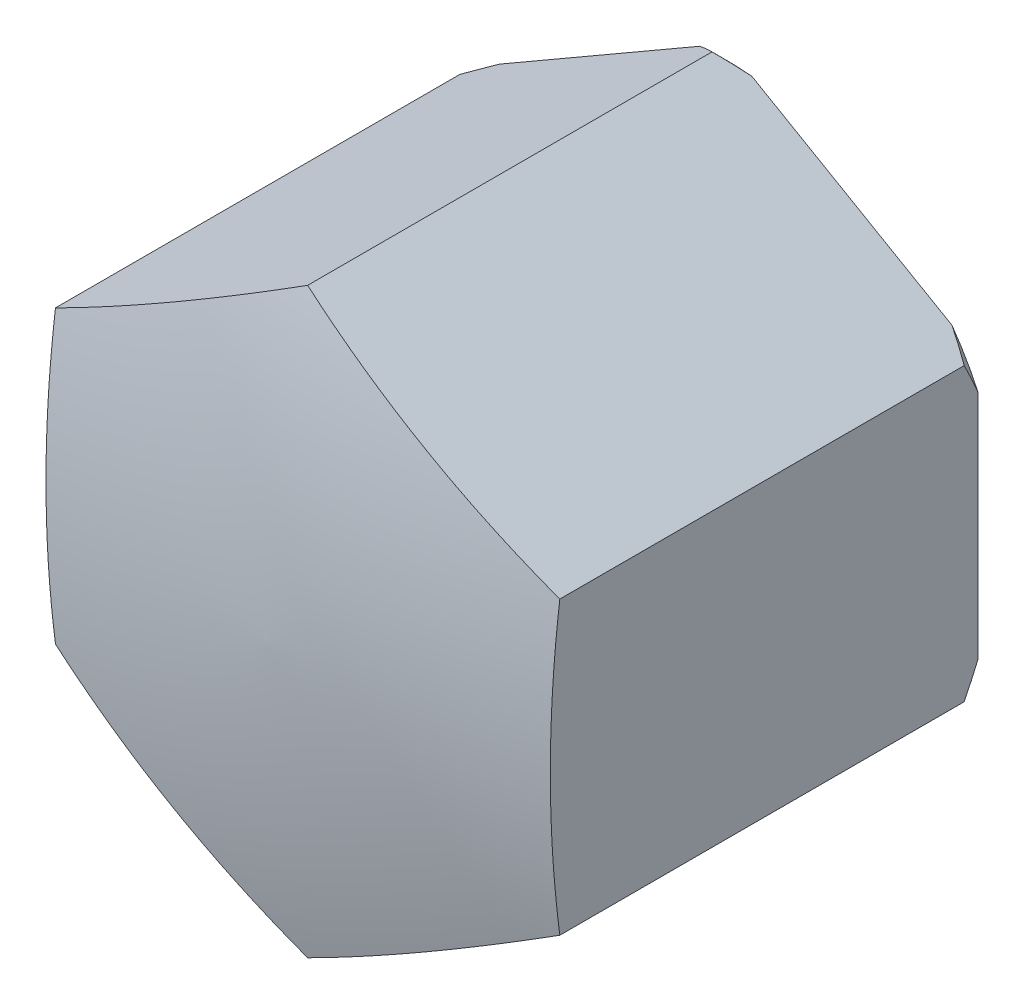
ISO-10303-21;
HEADER;
FILE_DESCRIPTION(('STEP AP214'),'2;1');
FILE_NAME('part.step','',(''),(''),'','','');
FILE_SCHEMA(('AUTOMOTIVE_DESIGN { 1 0 10303 214 1 1 1 1 }'));
ENDSEC;
DATA;
#1=APPLICATION_CONTEXT('core data for automotive mechanical design processes');
#2=APPLICATION_PROTOCOL_DEFINITION('international standard','automotive_design',2000,#1);
#3=PRODUCT_CONTEXT('',#1,'mechanical');
#4=PRODUCT('Part','Part','',(#3));
#5=PRODUCT_RELATED_PRODUCT_CATEGORY('part','',(#4));
#6=PRODUCT_DEFINITION_FORMATION('','',#4);
#7=PRODUCT_DEFINITION_CONTEXT('part definition',#1,'design');
#8=PRODUCT_DEFINITION('design','',#6,#7);
#9=PRODUCT_DEFINITION_SHAPE('','',#8);
#10=(LENGTH_UNIT() NAMED_UNIT(*) SI_UNIT(.MILLI.,.METRE.));
#11=(NAMED_UNIT(*) PLANE_ANGLE_UNIT() SI_UNIT($,.RADIAN.));
#12=(NAMED_UNIT(*) SI_UNIT($,.STERADIAN.) SOLID_ANGLE_UNIT());
#13=UNCERTAINTY_MEASURE_WITH_UNIT(LENGTH_MEASURE(1.E-05),#10,'distance_accuracy_value','');
#14=(GEOMETRIC_REPRESENTATION_CONTEXT(3) GLOBAL_UNCERTAINTY_ASSIGNED_CONTEXT((#13)) GLOBAL_UNIT_ASSIGNED_CONTEXT((#10,
#11,#12)) REPRESENTATION_CONTEXT('',''));
#15=CARTESIAN_POINT('',(0.,0.,0.));
#16=DIRECTION('',(0.,0.,1.));
#17=DIRECTION('',(1.,0.,0.));
#18=AXIS2_PLACEMENT_3D('',#15,#16,#17);
#19=CARTESIAN_POINT('',(0.,0.,0.));
#20=DIRECTION('',(0.,0.,1.));
#21=DIRECTION('',(0.,-1.,0.));
#22=AXIS2_PLACEMENT_3D('',#19,#20,#21);
#23=CONICAL_SURFACE('',#22,12.1,0.785398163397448);
#24=CARTESIAN_POINT('',(-9.86507388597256,7.00610285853,-0.000199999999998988));
#25=CARTESIAN_POINT('',(-9.96119990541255,6.95060447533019,0.0460383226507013));
#26=CARTESIAN_POINT('',(-10.0569364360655,6.89533096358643,0.0933496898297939));
#27=CARTESIAN_POINT('',(-10.2476169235,6.78524153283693,0.189970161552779));
#28=CARTESIAN_POINT('',(-10.3425611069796,6.73042548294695,0.239278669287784));
#29=CARTESIAN_POINT('',(-10.5316981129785,6.62122718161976,0.339771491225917));
#30=CARTESIAN_POINT('',(-10.6258909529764,6.56684492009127,0.390955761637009));
#31=CARTESIAN_POINT('',(-10.8135745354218,6.4584857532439,0.495094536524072));
#32=CARTESIAN_POINT('',(-10.9070650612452,6.40450897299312,0.548049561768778));
#33=CARTESIAN_POINT('',(-11.0002,6.35073749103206,0.601821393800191));
#34=B_SPLINE_CURVE_WITH_KNOTS('',3,(#24,#25,#26,#27,#28,#29,#30,#31,#32,#33),.UNSPECIFIED.,.F.,
.F.,(4,2,2,2,4),(0.,0.360718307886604,0.721329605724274,1.08193248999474,1.4426423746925),.UNSPECIFIED.);
#35=CARTESIAN_POINT('',(-9.86548966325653,7.00586280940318,0.));
#36=VERTEX_POINT('',#35);
#37=CARTESIAN_POINT('',(-11.,6.3508529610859,0.601705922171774));
#38=VERTEX_POINT('',#37);
#39=EDGE_CURVE('E130',#36,#38,#34,.T.);
#40=ORIENTED_EDGE('',*,*,#39,.F.);
#41=CARTESIAN_POINT('',(0.,0.,0.));
#42=DIRECTION('',(0.,0.,-1.));
#43=DIRECTION('',(0.,1.,0.));
#44=AXIS2_PLACEMENT_3D('',#41,#42,#43);
#45=CIRCLE('',#44,12.1);
#46=CARTESIAN_POINT('',(-11.,5.04083326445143,0.));
#47=VERTEX_POINT('',#46);
#48=EDGE_CURVE('E126',#47,#36,#45,.T.);
#49=ORIENTED_EDGE('',*,*,#48,.F.);
#50=CARTESIAN_POINT('',(-11.,16.0724477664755,7.37623108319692));
#51=CARTESIAN_POINT('',(-11.,15.8702057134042,7.2093371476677));
#52=CARTESIAN_POINT('',(-11.,15.6674737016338,7.04303709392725));
#53=CARTESIAN_POINT('',(-11.,15.2609313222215,6.71175492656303));
#54=CARTESIAN_POINT('',(-11.,15.0571209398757,6.54677283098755));
#55=CARTESIAN_POINT('',(-11.,14.4438351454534,6.05392702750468));
#56=CARTESIAN_POINT('',(-11.,14.0326017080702,5.72824373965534));
#57=CARTESIAN_POINT('',(-11.,13.1999564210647,5.08050106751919));
#58=CARTESIAN_POINT('',(-11.,12.7784823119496,4.75852150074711));
#59=CARTESIAN_POINT('',(-11.,11.9286566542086,4.12384110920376));
#60=CARTESIAN_POINT('',(-11.,11.5003057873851,3.81113937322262));
#61=CARTESIAN_POINT('',(-11.,10.5931500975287,3.16769731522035));
#62=CARTESIAN_POINT('',(-11.,10.1134868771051,2.83815635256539));
#63=CARTESIAN_POINT('',(-11.,9.38449294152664,2.35805816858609));
#64=CARTESIAN_POINT('',(-11.,9.13985858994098,2.20036220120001));
#65=CARTESIAN_POINT('',(-11.,8.64708986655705,1.89054685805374));
#66=CARTESIAN_POINT('',(-11.,8.39895566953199,1.73842720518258));
#67=CARTESIAN_POINT('',(-11.,7.89995903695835,1.441394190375));
#68=CARTESIAN_POINT('',(-11.,7.64911460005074,1.29645066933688));
#69=CARTESIAN_POINT('',(-11.,7.14316420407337,1.01414178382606));
#70=CARTESIAN_POINT('',(-11.,6.8880580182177,0.876776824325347));
#71=CARTESIAN_POINT('',(-11.,6.37340355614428,0.611087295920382));
#72=CARTESIAN_POINT('',(-11.,6.11385871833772,0.482756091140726));
#73=CARTESIAN_POINT('',(-11.,5.58983912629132,0.236644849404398));
#74=CARTESIAN_POINT('',(-11.,5.32536528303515,0.118862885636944));
#75=CARTESIAN_POINT('',(-11.,4.87055760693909,-0.0711489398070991));
#76=CARTESIAN_POINT('',(-11.,4.68153595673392,-0.146517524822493));
#77=CARTESIAN_POINT('',(-11.,4.30090682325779,-0.290396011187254));
#78=CARTESIAN_POINT('',(-11.,4.10929935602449,-0.35890595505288));
#79=CARTESIAN_POINT('',(-11.,3.53054922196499,-0.55302199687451));
#80=CARTESIAN_POINT('',(-11.,3.13947003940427,-0.667218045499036));
#81=CARTESIAN_POINT('',(-11.,2.3571577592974,-0.856520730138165));
#82=CARTESIAN_POINT('',(-11.,1.96613010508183,-0.932456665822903));
#83=CARTESIAN_POINT('',(-11.,1.3754168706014,-1.01606525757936));
#84=CARTESIAN_POINT('',(-11.,1.17780635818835,-1.03888598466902));
#85=CARTESIAN_POINT('',(-11.,0.781637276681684,-1.0740268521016));
#86=CARTESIAN_POINT('',(-11.,0.583078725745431,-1.0863471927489));
#87=CARTESIAN_POINT('',(-11.,0.196510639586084,-1.09984708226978));
#88=CARTESIAN_POINT('',(-11.,0.00852086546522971,-1.10160151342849));
#89=CARTESIAN_POINT('',(-11.,-0.367323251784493,-1.09547279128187));
#90=CARTESIAN_POINT('',(-11.,-0.555177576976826,-1.08758853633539));
#91=CARTESIAN_POINT('',(-11.,-0.930229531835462,-1.06232225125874));
#92=CARTESIAN_POINT('',(-11.,-1.11742721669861,-1.04494103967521));
#93=CARTESIAN_POINT('',(-11.,-1.49075054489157,-1.00099406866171));
#94=CARTESIAN_POINT('',(-11.,-1.67687603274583,-0.974427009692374));
#95=CARTESIAN_POINT('',(-11.,-2.24018324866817,-0.880381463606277));
#96=CARTESIAN_POINT('',(-11.,-2.61511811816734,-0.799063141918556));
#97=CARTESIAN_POINT('',(-11.,-3.35650285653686,-0.604878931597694));
#98=CARTESIAN_POINT('',(-11.,-3.72295280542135,-0.492013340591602));
#99=CARTESIAN_POINT('',(-11.,-4.4529629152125,-0.237887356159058));
#100=CARTESIAN_POINT('',(-11.,-4.81636046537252,-0.0961649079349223));
#101=CARTESIAN_POINT('',(-11.,-5.53386860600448,0.20927334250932));
#102=CARTESIAN_POINT('',(-11.,-5.88797506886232,0.372998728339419));
#103=CARTESIAN_POINT('',(-11.,-6.5885282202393,0.718563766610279));
#104=CARTESIAN_POINT('',(-11.,-6.93494780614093,0.900457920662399));
#105=CARTESIAN_POINT('',(-11.,-7.61987412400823,1.27837528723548));
#106=CARTESIAN_POINT('',(-11.,-7.95838202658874,1.47439639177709));
#107=CARTESIAN_POINT('',(-11.,-8.61194162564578,1.86785203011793));
#108=CARTESIAN_POINT('',(-11.,-8.92732558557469,2.06473756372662));
#109=CARTESIAN_POINT('',(-11.,-9.55267412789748,2.46695903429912));
#110=CARTESIAN_POINT('',(-11.,-9.86263830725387,2.67229559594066));
#111=CARTESIAN_POINT('',(-11.,-10.4753887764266,3.08826754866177));
#112=CARTESIAN_POINT('',(-11.,-10.7782124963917,3.29884800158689));
#113=CARTESIAN_POINT('',(-11.,-11.3796956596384,3.72570793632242));
#114=CARTESIAN_POINT('',(-11.,-11.6783562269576,3.94198583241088));
#115=CARTESIAN_POINT('',(-11.,-11.9752680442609,4.16059792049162));
#116=B_SPLINE_CURVE_WITH_KNOTS('',3,(#50,#51,#52,#53,#54,#55,#56,#57,#58,#59,#60,#61,#62,#63,
#64,#65,#66,#67,#68,#69,#70,#71,#72,#73,#74,#75,#76,#77,#78,#79,#80,#81,#82,#83,#84,#85,#86,#87,
#88,#89,#90,#91,#92,#93,#94,#95,#96,#97,#98,#99,#100,#101,#102,#103,#104,#105,#106,#107,#108,
#109,#110,#111,#112,#113,#114,#115),.UNSPECIFIED.,.F.,.F.,(4,2,2,2,2,2,2,2,2,2,2,2,2,2,2,2,2,2,
2,2,2,2,2,2,2,2,2,2,2,2,2,2,4),(0.,0.7866358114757,1.57328237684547,3.14695168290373,
4.73801099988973,6.32891353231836,8.0743905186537,8.94750152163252,9.82056907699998,
10.6895860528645,11.5586494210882,12.4270675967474,13.2953268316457,13.9056838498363,
14.5160370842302,15.7367149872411,16.9296541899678,17.5261883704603,18.1227111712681,
18.6864613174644,19.2502759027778,19.8140419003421,20.3778876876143,21.5270730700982,
22.6762476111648,23.845519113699,25.0153015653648,26.1887049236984,27.3619335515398,
28.4771587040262,29.5924664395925,30.698929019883,31.8050868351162),.UNSPECIFIED.);
#117=EDGE_CURVE('E155',#38,#47,#116,.T.);
#118=ORIENTED_EDGE('',*,*,#117,.F.);
#119=EDGE_LOOP('',(#40,#49,#118));
#120=FACE_BOUND('',#119,.T.);
#121=ADVANCED_FACE('F14',(#120),#23,.T.);
#122=CARTESIAN_POINT('',(-11.,-5.04083326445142,0.));
#123=VERTEX_POINT('',#122);
#124=CARTESIAN_POINT('',(-11.,-6.3508529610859,0.601705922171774));
#125=VERTEX_POINT('',#124);
#126=EDGE_CURVE('E151',#123,#125,#116,.T.);
#127=ORIENTED_EDGE('',*,*,#126,.F.);
#128=CARTESIAN_POINT('',(-9.86548966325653,-7.00586280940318,0.));
#129=VERTEX_POINT('',#128);
#130=EDGE_CURVE('E129',#129,#123,#45,.T.);
#131=ORIENTED_EDGE('',*,*,#130,.F.);
#132=CARTESIAN_POINT('',(-11.0002,-6.35073749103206,0.601821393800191));
#133=CARTESIAN_POINT('',(-10.9070650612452,-6.40450897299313,0.548049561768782));
#134=CARTESIAN_POINT('',(-10.8135745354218,-6.4584857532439,0.495094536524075));
#135=CARTESIAN_POINT('',(-10.6258909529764,-6.56684492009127,0.390955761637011));
#136=CARTESIAN_POINT('',(-10.5316981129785,-6.62122718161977,0.339771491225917));
#137=CARTESIAN_POINT('',(-10.3425611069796,-6.73042548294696,0.239278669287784));
#138=CARTESIAN_POINT('',(-10.2476169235,-6.78524153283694,0.189970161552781));
#139=CARTESIAN_POINT('',(-10.0569364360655,-6.89533096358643,0.093349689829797));
#140=CARTESIAN_POINT('',(-9.96119990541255,-6.95060447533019,0.0460383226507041));
#141=CARTESIAN_POINT('',(-9.86507388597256,-7.00610285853,-0.000200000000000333));
#142=B_SPLINE_CURVE_WITH_KNOTS('',3,(#132,#133,#134,#135,#136,#137,#138,#139,#140,#141),
.UNSPECIFIED.,.F.,.F.,(4,2,2,2,4),(0.,0.360709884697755,0.721312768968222,1.08192406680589,
1.4426423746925),.UNSPECIFIED.);
#143=EDGE_CURVE('E150',#125,#129,#142,.T.);
#144=ORIENTED_EDGE('',*,*,#143,.F.);
#145=EDGE_LOOP('',(#127,#131,#144));
#146=FACE_BOUND('',#145,.T.);
#147=ADVANCED_FACE('F149',(#146),#23,.T.);
#148=CARTESIAN_POINT('',(-1.13492611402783,-12.0464560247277,-0.000200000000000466));
#149=CARTESIAN_POINT('',(-1.03880009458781,-12.1019544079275,0.0460383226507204));
#150=CARTESIAN_POINT('',(-0.943063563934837,-12.1572279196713,0.0933496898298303));
#151=CARTESIAN_POINT('',(-0.75238307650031,-12.2673173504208,0.189970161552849));
#152=CARTESIAN_POINT('',(-0.657438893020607,-12.3221334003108,0.239278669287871));
#153=CARTESIAN_POINT('',(-0.468301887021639,-12.431331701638,0.339771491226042));
#154=CARTESIAN_POINT('',(-0.374109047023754,-12.4857139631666,0.390955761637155));
#155=CARTESIAN_POINT('',(-0.186425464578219,-12.594073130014,0.49509453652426));
#156=CARTESIAN_POINT('',(-0.0929349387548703,-12.6480499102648,0.548049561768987));
#157=CARTESIAN_POINT('',(0.000200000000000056,-12.7018213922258,0.601821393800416));
#158=B_SPLINE_CURVE_WITH_KNOTS('',3,(#148,#149,#150,#151,#152,#153,#154,#155,#156,#157),
.UNSPECIFIED.,.F.,.F.,(4,2,2,2,4),(0.,0.360718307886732,0.721329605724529,1.08193248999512,
1.44264237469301),.UNSPECIFIED.);
#159=CARTESIAN_POINT('',(-1.13451033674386,-12.0466960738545,0.));
#160=VERTEX_POINT('',#159);
#161=CARTESIAN_POINT('',(0.,-12.701705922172,0.601705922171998));
#162=VERTEX_POINT('',#161);
#163=EDGE_CURVE('E159',#160,#162,#158,.T.);
#164=ORIENTED_EDGE('',*,*,#163,.F.);
#165=CARTESIAN_POINT('',(1.13451033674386,-12.0466960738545,0.));
#166=VERTEX_POINT('',#165);
#167=EDGE_CURVE('E135',#166,#160,#45,.T.);
#168=ORIENTED_EDGE('',*,*,#167,.F.);
#169=CARTESIAN_POINT('',(-0.000200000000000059,-12.7018213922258,0.601821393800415));
#170=CARTESIAN_POINT('',(0.0929349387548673,-12.6480499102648,0.548049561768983));
#171=CARTESIAN_POINT('',(0.186425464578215,-12.594073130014,0.495094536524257));
#172=CARTESIAN_POINT('',(0.374109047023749,-12.4857139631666,0.390955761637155));
#173=CARTESIAN_POINT('',(0.468301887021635,-12.431331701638,0.339771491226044));
#174=CARTESIAN_POINT('',(0.6574388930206,-12.3221334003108,0.239278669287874));
#175=CARTESIAN_POINT('',(0.752383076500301,-12.2673173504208,0.189970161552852));
#176=CARTESIAN_POINT('',(0.943063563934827,-12.1572279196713,0.0933496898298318));
#177=CARTESIAN_POINT('',(1.0388000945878,-12.1019544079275,0.0460383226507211));
#178=CARTESIAN_POINT('',(1.13492611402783,-12.0464560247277,-0.000199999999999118));
#179=B_SPLINE_CURVE_WITH_KNOTS('',3,(#169,#170,#171,#172,#173,#174,#175,#176,#177,#178),
.UNSPECIFIED.,.F.,.F.,(4,2,2,2,4),(0.,0.360709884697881,0.721312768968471,1.08192406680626,
1.44264237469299),.UNSPECIFIED.);
#180=EDGE_CURVE('E306',#162,#166,#179,.T.);
#181=ORIENTED_EDGE('',*,*,#180,.F.);
#182=EDGE_LOOP('',(#164,#168,#181));
#183=FACE_BOUND('',#182,.T.);
#184=ADVANCED_FACE('F291',(#183),#23,.T.);
#185=CARTESIAN_POINT('',(9.86507388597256,-7.00610285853,-0.000199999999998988));
#186=CARTESIAN_POINT('',(9.96119990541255,-6.95060447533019,0.0460383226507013));
#187=CARTESIAN_POINT('',(10.0569364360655,-6.89533096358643,0.0933496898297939));
#188=CARTESIAN_POINT('',(10.2476169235,-6.78524153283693,0.189970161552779));
#189=CARTESIAN_POINT('',(10.3425611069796,-6.73042548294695,0.239278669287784));
#190=CARTESIAN_POINT('',(10.5316981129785,-6.62122718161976,0.339771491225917));
#191=CARTESIAN_POINT('',(10.6258909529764,-6.56684492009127,0.390955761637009));
#192=CARTESIAN_POINT('',(10.8135745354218,-6.4584857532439,0.495094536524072));
#193=CARTESIAN_POINT('',(10.9070650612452,-6.40450897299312,0.548049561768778));
#194=CARTESIAN_POINT('',(11.0002,-6.35073749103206,0.601821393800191));
#195=B_SPLINE_CURVE_WITH_KNOTS('',3,(#185,#186,#187,#188,#189,#190,#191,#192,#193,#194),
.UNSPECIFIED.,.F.,.F.,(4,2,2,2,4),(0.,0.360718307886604,0.721329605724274,1.08193248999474,
1.4426423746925),.UNSPECIFIED.);
#196=CARTESIAN_POINT('',(9.86548966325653,-7.00586280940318,0.));
#197=VERTEX_POINT('',#196);
#198=CARTESIAN_POINT('',(11.,-6.3508529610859,0.601705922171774));
#199=VERTEX_POINT('',#198);
#200=EDGE_CURVE('E302',#197,#199,#195,.T.);
#201=ORIENTED_EDGE('',*,*,#200,.F.);
#202=CARTESIAN_POINT('',(11.,-5.04083326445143,0.));
#203=VERTEX_POINT('',#202);
#204=EDGE_CURVE('E132',#203,#197,#45,.T.);
#205=ORIENTED_EDGE('',*,*,#204,.F.);
#206=CARTESIAN_POINT('',(11.,16.0724477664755,7.37623108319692));
#207=CARTESIAN_POINT('',(11.,15.8702057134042,7.2093371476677));
#208=CARTESIAN_POINT('',(11.,15.6674737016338,7.04303709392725));
#209=CARTESIAN_POINT('',(11.,15.2609313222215,6.71175492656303));
#210=CARTESIAN_POINT('',(11.,15.0571209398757,6.54677283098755));
#211=CARTESIAN_POINT('',(11.,14.4438351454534,6.05392702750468));
#212=CARTESIAN_POINT('',(11.,14.0326017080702,5.72824373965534));
#213=CARTESIAN_POINT('',(11.,13.1999564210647,5.08050106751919));
#214=CARTESIAN_POINT('',(11.,12.7784823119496,4.75852150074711));
#215=CARTESIAN_POINT('',(11.,11.9286566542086,4.12384110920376));
#216=CARTESIAN_POINT('',(11.,11.5003057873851,3.81113937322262));
#217=CARTESIAN_POINT('',(11.,10.5931500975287,3.16769731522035));
#218=CARTESIAN_POINT('',(11.,10.1134868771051,2.83815635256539));
#219=CARTESIAN_POINT('',(11.,9.38449294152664,2.35805816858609));
#220=CARTESIAN_POINT('',(11.,9.13985858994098,2.20036220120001));
#221=CARTESIAN_POINT('',(11.,8.64708986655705,1.89054685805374));
#222=CARTESIAN_POINT('',(11.,8.39895566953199,1.73842720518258));
#223=CARTESIAN_POINT('',(11.,7.89995903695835,1.441394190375));
#224=CARTESIAN_POINT('',(11.,7.64911460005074,1.29645066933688));
#225=CARTESIAN_POINT('',(11.,7.14316420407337,1.01414178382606));
#226=CARTESIAN_POINT('',(11.,6.8880580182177,0.876776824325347));
#227=CARTESIAN_POINT('',(11.,6.37340355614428,0.611087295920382));
#228=CARTESIAN_POINT('',(11.,6.11385871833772,0.482756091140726));
#229=CARTESIAN_POINT('',(11.,5.58983912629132,0.236644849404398));
#230=CARTESIAN_POINT('',(11.,5.32536528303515,0.118862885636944));
#231=CARTESIAN_POINT('',(11.,4.87055760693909,-0.0711489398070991));
#232=CARTESIAN_POINT('',(11.,4.68153595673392,-0.146517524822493));
#233=CARTESIAN_POINT('',(11.,4.30090682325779,-0.290396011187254));
#234=CARTESIAN_POINT('',(11.,4.10929935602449,-0.35890595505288));
#235=CARTESIAN_POINT('',(11.,3.53054922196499,-0.55302199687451));
#236=CARTESIAN_POINT('',(11.,3.13947003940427,-0.667218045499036));
#237=CARTESIAN_POINT('',(11.,2.3571577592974,-0.856520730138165));
#238=CARTESIAN_POINT('',(11.,1.96613010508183,-0.932456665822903));
#239=CARTESIAN_POINT('',(11.,1.3754168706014,-1.01606525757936));
#240=CARTESIAN_POINT('',(11.,1.17780635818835,-1.03888598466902));
#241=CARTESIAN_POINT('',(11.,0.781637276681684,-1.0740268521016));
#242=CARTESIAN_POINT('',(11.,0.583078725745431,-1.0863471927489));
#243=CARTESIAN_POINT('',(11.,0.196510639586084,-1.09984708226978));
#244=CARTESIAN_POINT('',(11.,0.00852086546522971,-1.10160151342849));
#245=CARTESIAN_POINT('',(11.,-0.367323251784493,-1.09547279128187));
#246=CARTESIAN_POINT('',(11.,-0.555177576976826,-1.08758853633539));
#247=CARTESIAN_POINT('',(11.,-0.930229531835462,-1.06232225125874));
#248=CARTESIAN_POINT('',(11.,-1.11742721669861,-1.04494103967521));
#249=CARTESIAN_POINT('',(11.,-1.49075054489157,-1.00099406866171));
#250=CARTESIAN_POINT('',(11.,-1.67687603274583,-0.974427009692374));
#251=CARTESIAN_POINT('',(11.,-2.24018324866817,-0.880381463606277));
#252=CARTESIAN_POINT('',(11.,-2.61511811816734,-0.799063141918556));
#253=CARTESIAN_POINT('',(11.,-3.35650285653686,-0.604878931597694));
#254=CARTESIAN_POINT('',(11.,-3.72295280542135,-0.492013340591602));
#255=CARTESIAN_POINT('',(11.,-4.4529629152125,-0.237887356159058));
#256=CARTESIAN_POINT('',(11.,-4.81636046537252,-0.0961649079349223));
#257=CARTESIAN_POINT('',(11.,-5.53386860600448,0.20927334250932));
#258=CARTESIAN_POINT('',(11.,-5.88797506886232,0.372998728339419));
#259=CARTESIAN_POINT('',(11.,-6.5885282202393,0.718563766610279));
#260=CARTESIAN_POINT('',(11.,-6.93494780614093,0.900457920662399));
#261=CARTESIAN_POINT('',(11.,-7.61987412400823,1.27837528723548));
#262=CARTESIAN_POINT('',(11.,-7.95838202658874,1.47439639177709));
#263=CARTESIAN_POINT('',(11.,-8.61194162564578,1.86785203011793));
#264=CARTESIAN_POINT('',(11.,-8.92732558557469,2.06473756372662));
#265=CARTESIAN_POINT('',(11.,-9.55267412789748,2.46695903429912));
#266=CARTESIAN_POINT('',(11.,-9.86263830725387,2.67229559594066));
#267=CARTESIAN_POINT('',(11.,-10.4753887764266,3.08826754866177));
#268=CARTESIAN_POINT('',(11.,-10.7782124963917,3.29884800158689));
#269=CARTESIAN_POINT('',(11.,-11.3796956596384,3.72570793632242));
#270=CARTESIAN_POINT('',(11.,-11.6783562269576,3.94198583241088));
#271=CARTESIAN_POINT('',(11.,-11.9752680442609,4.16059792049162));
#272=B_SPLINE_CURVE_WITH_KNOTS('',3,(#206,#207,#208,#209,#210,#211,#212,#213,#214,#215,#216,
#217,#218,#219,#220,#221,#222,#223,#224,#225,#226,#227,#228,#229,#230,#231,#232,#233,#234,#235,
#236,#237,#238,#239,#240,#241,#242,#243,#244,#245,#246,#247,#248,#249,#250,#251,#252,#253,#254,
#255,#256,#257,#258,#259,#260,#261,#262,#263,#264,#265,#266,#267,#268,#269,#270,#271),
.UNSPECIFIED.,.F.,.F.,(4,2,2,2,2,2,2,2,2,2,2,2,2,2,2,2,2,2,2,2,2,2,2,2,2,2,2,2,2,2,2,2,4),(0.,
0.7866358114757,1.57328237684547,3.14695168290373,4.73801099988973,6.32891353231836,
8.0743905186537,8.94750152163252,9.82056907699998,10.6895860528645,11.5586494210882,
12.4270675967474,13.2953268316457,13.9056838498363,14.5160370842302,15.7367149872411,
16.9296541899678,17.5261883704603,18.1227111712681,18.6864613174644,19.2502759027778,
19.8140419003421,20.3778876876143,21.5270730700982,22.6762476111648,23.845519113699,
25.0153015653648,26.1887049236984,27.3619335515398,28.4771587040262,29.5924664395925,
30.698929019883,31.8050868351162),.UNSPECIFIED.);
#273=EDGE_CURVE('E226',#199,#203,#272,.F.);
#274=ORIENTED_EDGE('',*,*,#273,.F.);
#275=EDGE_LOOP('',(#201,#205,#274));
#276=FACE_BOUND('',#275,.T.);
#277=ADVANCED_FACE('F301',(#276),#23,.T.);
#278=CARTESIAN_POINT('',(0.000200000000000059,12.7018213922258,0.601821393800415));
#279=CARTESIAN_POINT('',(-0.0929349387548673,12.6480499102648,0.548049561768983));
#280=CARTESIAN_POINT('',(-0.186425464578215,12.594073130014,0.495094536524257));
#281=CARTESIAN_POINT('',(-0.374109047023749,12.4857139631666,0.390955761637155));
#282=CARTESIAN_POINT('',(-0.468301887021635,12.431331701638,0.339771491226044));
#283=CARTESIAN_POINT('',(-0.6574388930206,12.3221334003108,0.239278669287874));
#284=CARTESIAN_POINT('',(-0.752383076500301,12.2673173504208,0.189970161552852));
#285=CARTESIAN_POINT('',(-0.943063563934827,12.1572279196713,0.0933496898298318));
#286=CARTESIAN_POINT('',(-1.0388000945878,12.1019544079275,0.0460383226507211));
#287=CARTESIAN_POINT('',(-1.13492611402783,12.0464560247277,-0.000199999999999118));
#288=B_SPLINE_CURVE_WITH_KNOTS('',3,(#278,#279,#280,#281,#282,#283,#284,#285,#286,#287),
.UNSPECIFIED.,.F.,.F.,(4,2,2,2,4),(0.,0.360709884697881,0.721312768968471,1.08192406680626,
1.44264237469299),.UNSPECIFIED.);
#289=CARTESIAN_POINT('',(0.,12.701705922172,0.601705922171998));
#290=VERTEX_POINT('',#289);
#291=CARTESIAN_POINT('',(-1.13451033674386,12.0466960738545,0.));
#292=VERTEX_POINT('',#291);
#293=EDGE_CURVE('E119',#290,#292,#288,.T.);
#294=ORIENTED_EDGE('',*,*,#293,.F.);
#295=CARTESIAN_POINT('',(1.13492611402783,12.0464560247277,-0.000200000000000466));
#296=CARTESIAN_POINT('',(1.03880009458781,12.1019544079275,0.0460383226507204));
#297=CARTESIAN_POINT('',(0.943063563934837,12.1572279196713,0.0933496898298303));
#298=CARTESIAN_POINT('',(0.75238307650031,12.2673173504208,0.189970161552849));
#299=CARTESIAN_POINT('',(0.657438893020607,12.3221334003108,0.239278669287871));
#300=CARTESIAN_POINT('',(0.468301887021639,12.431331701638,0.339771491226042));
#301=CARTESIAN_POINT('',(0.374109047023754,12.4857139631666,0.390955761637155));
#302=CARTESIAN_POINT('',(0.186425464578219,12.594073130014,0.49509453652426));
#303=CARTESIAN_POINT('',(0.0929349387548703,12.6480499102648,0.548049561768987));
#304=CARTESIAN_POINT('',(-0.000200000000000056,12.7018213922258,0.601821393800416));
#305=B_SPLINE_CURVE_WITH_KNOTS('',3,(#295,#296,#297,#298,#299,#300,#301,#302,#303,#304),
.UNSPECIFIED.,.F.,.F.,(4,2,2,2,4),(0.,0.360718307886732,0.721329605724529,1.08193248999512,
1.44264237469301),.UNSPECIFIED.);
#306=CARTESIAN_POINT('',(1.13451033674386,12.0466960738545,0.));
#307=VERTEX_POINT('',#306);
#308=EDGE_CURVE('E106',#307,#290,#305,.T.);
#309=ORIENTED_EDGE('',*,*,#308,.F.);
#310=EDGE_CURVE('E118',#292,#307,#45,.T.);
#311=ORIENTED_EDGE('',*,*,#310,.F.);
#312=EDGE_LOOP('',(#294,#309,#311));
#313=FACE_BOUND('',#312,.T.);
#314=ADVANCED_FACE('F117',(#313),#23,.T.);
#315=CARTESIAN_POINT('',(11.,5.04083326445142,0.));
#316=VERTEX_POINT('',#315);
#317=CARTESIAN_POINT('',(11.,6.3508529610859,0.601705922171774));
#318=VERTEX_POINT('',#317);
#319=EDGE_CURVE('E224',#316,#318,#272,.F.);
#320=ORIENTED_EDGE('',*,*,#319,.F.);
#321=CARTESIAN_POINT('',(9.86548966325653,7.00586280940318,0.));
#322=VERTEX_POINT('',#321);
#323=EDGE_CURVE('E112',#322,#316,#45,.T.);
#324=ORIENTED_EDGE('',*,*,#323,.F.);
#325=CARTESIAN_POINT('',(11.0002,6.35073749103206,0.601821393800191));
#326=CARTESIAN_POINT('',(10.9070650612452,6.40450897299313,0.548049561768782));
#327=CARTESIAN_POINT('',(10.8135745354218,6.4584857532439,0.495094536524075));
#328=CARTESIAN_POINT('',(10.6258909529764,6.56684492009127,0.390955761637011));
#329=CARTESIAN_POINT('',(10.5316981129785,6.62122718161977,0.339771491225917));
#330=CARTESIAN_POINT('',(10.3425611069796,6.73042548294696,0.239278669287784));
#331=CARTESIAN_POINT('',(10.2476169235,6.78524153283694,0.189970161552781));
#332=CARTESIAN_POINT('',(10.0569364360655,6.89533096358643,0.093349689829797));
#333=CARTESIAN_POINT('',(9.96119990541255,6.95060447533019,0.0460383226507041));
#334=CARTESIAN_POINT('',(9.86507388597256,7.00610285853,-0.000200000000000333));
#335=B_SPLINE_CURVE_WITH_KNOTS('',3,(#325,#326,#327,#328,#329,#330,#331,#332,#333,#334),
.UNSPECIFIED.,.F.,.F.,(4,2,2,2,4),(0.,0.360709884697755,0.721312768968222,1.08192406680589,
1.4426423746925),.UNSPECIFIED.);
#336=EDGE_CURVE('E37',#318,#322,#335,.T.);
#337=ORIENTED_EDGE('',*,*,#336,.F.);
#338=EDGE_LOOP('',(#320,#324,#337));
#339=FACE_BOUND('',#338,.T.);
#340=ADVANCED_FACE('F177',(#339),#23,.T.);
#341=CARTESIAN_POINT('',(12.1,0.,0.));
#342=DIRECTION('',(0.,0.,-1.));
#343=DIRECTION('',(0.,1.,0.));
#344=AXIS2_PLACEMENT_3D('',#341,#342,#343);
#345=PLANE('',#344);
#346=DIRECTION('',(-0.866025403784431,-0.500000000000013,0.));
#347=VECTOR('',#346,1.);
#348=CARTESIAN_POINT('',(3.57499999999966,14.7657331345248,0.));
#349=LINE('',#348,#347);
#350=EDGE_CURVE('E9',#292,#36,#349,.T.);
#351=ORIENTED_EDGE('',*,*,#350,.F.);
#352=ORIENTED_EDGE('',*,*,#310,.T.);
#353=DIRECTION('',(-0.866025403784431,0.500000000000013,0.));
#354=VECTOR('',#353,1.);
#355=CARTESIAN_POINT('',(14.575,4.28682574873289,0.));
#356=LINE('',#355,#354);
#357=EDGE_CURVE('E103',#322,#307,#356,.T.);
#358=ORIENTED_EDGE('',*,*,#357,.F.);
#359=ORIENTED_EDGE('',*,*,#323,.T.);
#360=DIRECTION('',(0.,1.,0.));
#361=VECTOR('',#360,1.);
#362=CARTESIAN_POINT('',(11.,0.,0.));
#363=LINE('',#362,#361);
#364=EDGE_CURVE('E111',#203,#316,#363,.T.);
#365=ORIENTED_EDGE('',*,*,#364,.F.);
#366=ORIENTED_EDGE('',*,*,#204,.T.);
#367=DIRECTION('',(0.866025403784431,0.500000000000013,0.));
#368=VECTOR('',#367,1.);
#369=CARTESIAN_POINT('',(14.575,-4.28682574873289,0.));
#370=LINE('',#369,#368);
#371=EDGE_CURVE('E292',#166,#197,#370,.T.);
#372=ORIENTED_EDGE('',*,*,#371,.F.);
#373=ORIENTED_EDGE('',*,*,#167,.T.);
#374=DIRECTION('',(0.866025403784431,-0.500000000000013,0.));
#375=VECTOR('',#374,1.);
#376=CARTESIAN_POINT('',(3.57499999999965,-14.7657331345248,0.));
#377=LINE('',#376,#375);
#378=EDGE_CURVE('E145',#129,#160,#377,.T.);
#379=ORIENTED_EDGE('',*,*,#378,.F.);
#380=ORIENTED_EDGE('',*,*,#130,.T.);
#381=DIRECTION('',(0.,-1.,0.));
#382=VECTOR('',#381,1.);
#383=CARTESIAN_POINT('',(-11.,0.,0.));
#384=LINE('',#383,#382);
#385=EDGE_CURVE('E23',#47,#123,#384,.T.);
#386=ORIENTED_EDGE('',*,*,#385,.F.);
#387=ORIENTED_EDGE('',*,*,#48,.T.);
#388=EDGE_LOOP('',(#351,#352,#358,#359,#365,#366,#372,#373,#379,#380,#386,#387));
#389=FACE_BOUND('',#388,.T.);
#390=CARTESIAN_POINT('',(0.,0.,0.));
#391=DIRECTION('',(0.,0.,-1.));
#392=DIRECTION('',(-1.,0.,0.));
#393=AXIS2_PLACEMENT_3D('',#390,#391,#392);
#394=CIRCLE('',#393,6.);
#395=CARTESIAN_POINT('',(-6.,0.,0.));
#396=VERTEX_POINT('',#395);
#397=EDGE_CURVE('E269',#396,#396,#394,.T.);
#398=ORIENTED_EDGE('',*,*,#397,.F.);
#399=EDGE_LOOP('',(#398));
#400=FACE_BOUND('',#399,.T.);
#401=ADVANCED_FACE('F123',(#389,#400),#345,.T.);
#402=CARTESIAN_POINT('',(0.,12.701705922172,21.));
#403=DIRECTION('',(0.500000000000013,-0.866025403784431,0.));
#404=DIRECTION('',(0.866025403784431,0.500000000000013,0.));
#405=AXIS2_PLACEMENT_3D('',#402,#403,#404);
#406=PLANE('',#405);
#407=CARTESIAN_POINT('',(-11.0002,6.35073749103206,18.2416780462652));
#408=CARTESIAN_POINT('',(-10.5434442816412,6.61444552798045,18.3102571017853));
#409=CARTESIAN_POINT('',(-10.0857401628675,6.87870112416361,18.3704696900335));
#410=CARTESIAN_POINT('',(-9.16888280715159,7.40804896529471,18.4739127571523));
#411=CARTESIAN_POINT('',(-8.70972952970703,7.67314123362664,18.5171427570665));
#412=CARTESIAN_POINT('',(-7.79238468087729,8.20277052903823,18.5862216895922));
#413=CARTESIAN_POINT('',(-7.33419721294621,8.46730518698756,18.612143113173));
#414=CARTESIAN_POINT('',(-6.41733982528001,8.99665304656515,18.646725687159));
#415=CARTESIAN_POINT('',(-5.95866991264,9.26146624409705,18.6553870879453));
#416=CARTESIAN_POINT('',(-5.04133008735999,9.79109263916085,18.6553870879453));
#417=CARTESIAN_POINT('',(-4.58266017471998,10.0559058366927,18.646725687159));
#418=CARTESIAN_POINT('',(-3.66580278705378,10.5852536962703,18.612143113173));
#419=CARTESIAN_POINT('',(-3.20761531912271,10.8497883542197,18.5862216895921));
#420=CARTESIAN_POINT('',(-2.29027047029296,11.3794176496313,18.5171427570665));
#421=CARTESIAN_POINT('',(-1.8311171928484,11.6445099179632,18.4739127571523));
#422=CARTESIAN_POINT('',(-0.914259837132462,12.1738577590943,18.3704696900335));
#423=CARTESIAN_POINT('',(-0.456555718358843,12.4381133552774,18.3102571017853));
#424=CARTESIAN_POINT('',(0.000200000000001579,12.7018213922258,18.2416780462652));
#425=B_SPLINE_CURVE_WITH_KNOTS('',3,(#407,#408,#409,#410,#411,#412,#413,#414,#415,#416,#417,
#418,#419,#420,#421,#422,#423,#424),.UNSPECIFIED.,.F.,.F.,(4,2,2,2,2,2,2,2,4),(0.,
1.59551190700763,3.19106880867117,4.77990064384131,6.36870943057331,7.95751821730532,
9.54635005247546,11.141906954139,12.7374188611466),.UNSPECIFIED.);
#426=CARTESIAN_POINT('',(-11.,6.3508529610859,18.2417080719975));
#427=VERTEX_POINT('',#426);
#428=CARTESIAN_POINT('',(0.,12.701705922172,18.2417080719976));
#429=VERTEX_POINT('',#428);
#430=EDGE_CURVE('E127',#427,#429,#425,.T.);
#431=ORIENTED_EDGE('',*,*,#430,.T.);
#432=DIRECTION('',(0.,0.,-1.));
#433=VECTOR('',#432,1.);
#434=CARTESIAN_POINT('',(0.,12.701705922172,21.));
#435=LINE('',#434,#433);
#436=EDGE_CURVE('E30',#429,#290,#435,.T.);
#437=ORIENTED_EDGE('',*,*,#436,.T.);
#438=ORIENTED_EDGE('',*,*,#293,.T.);
#439=ORIENTED_EDGE('',*,*,#350,.T.);
#440=ORIENTED_EDGE('',*,*,#39,.T.);
#441=DIRECTION('',(0.,0.,-1.));
#442=VECTOR('',#441,1.);
#443=CARTESIAN_POINT('',(-11.,6.3508529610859,21.));
#444=LINE('',#443,#442);
#445=EDGE_CURVE('E211',#427,#38,#444,.T.);
#446=ORIENTED_EDGE('',*,*,#445,.F.);
#447=EDGE_LOOP('',(#431,#437,#438,#439,#440,#446));
#448=FACE_BOUND('',#447,.T.);
#449=ADVANCED_FACE('F185',(#448),#406,.F.);
#450=CARTESIAN_POINT('',(-11.,6.3508529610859,21.));
#451=DIRECTION('',(1.,0.,0.));
#452=DIRECTION('',(0.,1.,0.));
#453=AXIS2_PLACEMENT_3D('',#450,#451,#452);
#454=PLANE('',#453);
#455=CARTESIAN_POINT('',(-11.,0.,18.6553870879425));
#456=CARTESIAN_POINT('',(-11.,0.935870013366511,18.6553811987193));
#457=CARTESIAN_POINT('',(-11.,1.87178979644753,18.6283039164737));
#458=CARTESIAN_POINT('',(-11.,3.74034538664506,18.5205991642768));
#459=CARTESIAN_POINT('',(-11.,4.67298169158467,18.4399801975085));
#460=CARTESIAN_POINT('',(-11.,6.53278460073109,18.2265316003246));
#461=CARTESIAN_POINT('',(-11.,7.45994788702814,18.0936730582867));
#462=CARTESIAN_POINT('',(-11.,9.30569682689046,17.7772368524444));
#463=CARTESIAN_POINT('',(-11.,10.2242806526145,17.5936486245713));
#464=CARTESIAN_POINT('',(-11.,12.5841437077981,17.0552860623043));
#465=CARTESIAN_POINT('',(-11.,14.01706877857,16.6631780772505));
#466=CARTESIAN_POINT('',(-11.,16.8450187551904,15.7596273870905));
#467=CARTESIAN_POINT('',(-11.,18.2400328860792,15.2481511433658));
#468=CARTESIAN_POINT('',(-11.,20.9838274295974,14.1098534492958));
#469=CARTESIAN_POINT('',(-11.,22.3325606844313,13.482918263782));
#470=CARTESIAN_POINT('',(-11.,24.9730077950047,12.1189655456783));
#471=CARTESIAN_POINT('',(-11.,26.2647259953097,11.3819564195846));
#472=CARTESIAN_POINT('',(-11.,28.7872069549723,9.80021891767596));
#473=CARTESIAN_POINT('',(-11.,30.0177225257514,8.95509632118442));
#474=CARTESIAN_POINT('',(-11.,32.4041386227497,7.16532547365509));
#475=CARTESIAN_POINT('',(-11.,33.560037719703,6.22067531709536));
#476=CARTESIAN_POINT('',(-11.,35.7889357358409,4.23878894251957));
#477=CARTESIAN_POINT('',(-11.,36.8619583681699,3.20157939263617));
#478=CARTESIAN_POINT('',(-11.,38.9180974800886,1.04158014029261));
#479=CARTESIAN_POINT('',(-11.,39.9012136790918,-0.0812098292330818));
#480=CARTESIAN_POINT('',(-11.,41.7826729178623,-2.41935375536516));
#481=CARTESIAN_POINT('',(-11.,42.6797796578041,-3.63570282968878));
#482=CARTESIAN_POINT('',(-11.,44.3685312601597,-6.13954250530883));
#483=CARTESIAN_POINT('',(-11.,45.1601750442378,-7.4270338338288));
#484=CARTESIAN_POINT('',(-11.,46.6324855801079,-10.0641519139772));
#485=CARTESIAN_POINT('',(-11.,47.3131410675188,-11.4137849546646));
#486=CARTESIAN_POINT('',(-11.,48.558572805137,-14.165494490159));
#487=CARTESIAN_POINT('',(-11.,49.1233491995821,-15.5675709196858));
#488=CARTESIAN_POINT('',(-11.,50.1339505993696,-18.4168092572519));
#489=CARTESIAN_POINT('',(-11.,50.5795591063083,-19.8640479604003));
#490=CARTESIAN_POINT('',(-11.,51.3473236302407,-22.790910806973));
#491=CARTESIAN_POINT('',(-11.,51.6694794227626,-24.270535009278));
#492=CARTESIAN_POINT('',(-11.,52.1880496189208,-27.2516195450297));
#493=CARTESIAN_POINT('',(-11.,52.384467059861,-28.753079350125));
#494=CARTESIAN_POINT('',(-11.,52.6501815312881,-31.7672048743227));
#495=CARTESIAN_POINT('',(-11.,52.719478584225,-33.2798705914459));
#496=CARTESIAN_POINT('',(-11.,52.7304638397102,-36.3063262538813));
#497=CARTESIAN_POINT('',(-11.,52.6720963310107,-37.8201164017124));
#498=CARTESIAN_POINT('',(-11.,52.4280522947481,-40.8374002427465));
#499=CARTESIAN_POINT('',(-11.,52.2423757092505,-42.3408939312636));
#500=CARTESIAN_POINT('',(-11.,51.745020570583,-45.3269516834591));
#501=CARTESIAN_POINT('',(-11.,51.4333373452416,-46.809514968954));
#502=CARTESIAN_POINT('',(-11.,50.6861785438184,-49.7431129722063));
#503=CARTESIAN_POINT('',(-11.,50.2507029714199,-51.1941476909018));
#504=CARTESIAN_POINT('',(-11.,49.2590216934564,-54.0544402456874));
#505=CARTESIAN_POINT('',(-11.,48.7028099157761,-55.4636959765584));
#506=CARTESIAN_POINT('',(-11.,47.4736121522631,-58.2303260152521));
#507=CARTESIAN_POINT('',(-11.,46.8006261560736,-59.5877003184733));
#508=CARTESIAN_POINT('',(-11.,45.342724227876,-62.2407678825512));
#509=CARTESIAN_POINT('',(-11.,44.5578195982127,-63.5364673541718));
#510=CARTESIAN_POINT('',(-11.,42.8815913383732,-66.0570980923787));
#511=CARTESIAN_POINT('',(-11.,41.9902677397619,-67.2820293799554));
#512=CARTESIAN_POINT('',(-11.,40.1079383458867,-69.6518500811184));
#513=CARTESIAN_POINT('',(-11.,39.116977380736,-70.796775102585));
#514=CARTESIAN_POINT('',(-11.,37.0420532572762,-72.9990012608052));
#515=CARTESIAN_POINT('',(-11.,35.9580901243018,-74.0563024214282));
#516=CARTESIAN_POINT('',(-11.,33.7045440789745,-76.075946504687));
#517=CARTESIAN_POINT('',(-11.,32.5349395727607,-77.0382653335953));
#518=CARTESIAN_POINT('',(-11.,30.1186204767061,-78.8606800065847));
#519=CARTESIAN_POINT('',(-11.,28.8719056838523,-79.7207755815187));
#520=CARTESIAN_POINT('',(-11.,26.3121103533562,-81.3312157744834));
#521=CARTESIAN_POINT('',(-11.,24.9991321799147,-82.0817230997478));
#522=CARTESIAN_POINT('',(-11.,22.314326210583,-83.4688678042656));
#523=CARTESIAN_POINT('',(-11.,20.9424989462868,-84.105506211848));
#524=CARTESIAN_POINT('',(-11.,18.1500121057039,-85.2596723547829));
#525=CARTESIAN_POINT('',(-11.,16.7293631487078,-85.7772258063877));
#526=CARTESIAN_POINT('',(-11.,13.8485738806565,-86.6887100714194));
#527=CARTESIAN_POINT('',(-11.,12.388431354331,-87.0826339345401));
#528=CARTESIAN_POINT('',(-11.,10.1840642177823,-87.5753173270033));
#529=CARTESIAN_POINT('',(-11.,9.45040677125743,-87.7227105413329));
#530=CARTESIAN_POINT('',(-11.,7.97726338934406,-87.9852418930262));
#531=CARTESIAN_POINT('',(-11.,7.23777730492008,-88.1003792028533));
#532=CARTESIAN_POINT('',(-11.,5.75448942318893,-88.2976135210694));
#533=CARTESIAN_POINT('',(-11.,5.01068804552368,-88.3797136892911));
#534=CARTESIAN_POINT('',(-11.,3.52019982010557,-88.5101252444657));
#535=CARTESIAN_POINT('',(-11.,2.77351330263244,-88.558440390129));
#536=CARTESIAN_POINT('',(-11.,1.27902670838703,-88.62068364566));
#537=CARTESIAN_POINT('',(-11.,0.531227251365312,-88.634626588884));
#538=CARTESIAN_POINT('',(-11.,-0.964220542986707,-88.6279664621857));
#539=CARTESIAN_POINT('',(-11.,-1.71186887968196,-88.607363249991));
#540=CARTESIAN_POINT('',(-11.,-3.2054279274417,-88.5319042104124));
#541=CARTESIAN_POINT('',(-11.,-3.95133863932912,-88.4770483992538));
#542=CARTESIAN_POINT('',(-11.,-5.43998969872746,-88.3337246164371));
#543=CARTESIAN_POINT('',(-11.,-6.18272972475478,-88.2452533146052));
#544=CARTESIAN_POINT('',(-11.,-7.61466475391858,-88.0423911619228));
#545=CARTESIAN_POINT('',(-11.,-8.30415742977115,-87.9300971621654));
#546=CARTESIAN_POINT('',(-11.,-9.67791469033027,-87.6774809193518));
#547=CARTESIAN_POINT('',(-11.,-10.3621794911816,-87.5371598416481));
#548=CARTESIAN_POINT('',(-11.,-12.405544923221,-87.0749879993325));
#549=CARTESIAN_POINT('',(-11.,-13.7555489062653,-86.711881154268));
#550=CARTESIAN_POINT('',(-11.,-16.4231164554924,-85.8795139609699));
#551=CARTESIAN_POINT('',(-11.,-17.7406595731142,-85.4101885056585));
#552=CARTESIAN_POINT('',(-11.,-20.3347452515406,-84.3692389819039));
#553=CARTESIAN_POINT('',(-11.,-21.6112868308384,-83.7976124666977));
#554=CARTESIAN_POINT('',(-11.,-24.1839231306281,-82.5221845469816));
#555=CARTESIAN_POINT('',(-11.,-25.4772908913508,-81.8128769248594));
#556=CARTESIAN_POINT('',(-11.,-28.0011833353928,-80.2900491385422));
#557=CARTESIAN_POINT('',(-11.,-29.2317057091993,-79.4765251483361));
#558=CARTESIAN_POINT('',(-11.,-31.6213436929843,-77.7511730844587));
#559=CARTESIAN_POINT('',(-11.,-32.7804762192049,-76.8393684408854));
#560=CARTESIAN_POINT('',(-11.,-35.0198719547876,-74.9235784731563));
#561=CARTESIAN_POINT('',(-11.,-36.1001348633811,-73.9195927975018));
#562=CARTESIAN_POINT('',(-11.,-38.1986082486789,-71.801998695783));
#563=CARTESIAN_POINT('',(-11.,-39.2147999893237,-70.6863887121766));
#564=CARTESIAN_POINT('',(-11.,-41.1498946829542,-68.3737393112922));
#565=CARTESIAN_POINT('',(-11.,-42.0687957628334,-67.1766983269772));
#566=CARTESIAN_POINT('',(-11.,-43.8029933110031,-64.7094581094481));
#567=CARTESIAN_POINT('',(-11.,-44.6182710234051,-63.4392456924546));
#568=CARTESIAN_POINT('',(-11.,-46.13928770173,-60.8348558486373));
#569=CARTESIAN_POINT('',(-11.,-46.8450269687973,-59.5006785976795));
#570=CARTESIAN_POINT('',(-11.,-48.1439325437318,-56.7737391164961));
#571=CARTESIAN_POINT('',(-11.,-48.7367584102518,-55.3808147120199));
#572=CARTESIAN_POINT('',(-11.,-49.8030335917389,-52.5499973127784));
#573=CARTESIAN_POINT('',(-11.,-50.2764825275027,-51.1121041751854));
#574=CARTESIAN_POINT('',(-11.,-51.1006307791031,-48.2016361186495));
#575=CARTESIAN_POINT('',(-11.,-51.4513361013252,-46.7290629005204));
#576=CARTESIAN_POINT('',(-11.,-52.0275466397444,-43.7596228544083));
#577=CARTESIAN_POINT('',(-11.,-52.2530519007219,-42.2627560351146));
#578=CARTESIAN_POINT('',(-11.,-52.5773793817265,-39.2543034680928));
#579=CARTESIAN_POINT('',(-11.,-52.67611314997,-37.7427081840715));
#580=CARTESIAN_POINT('',(-11.,-52.7459075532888,-34.7165722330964));
#581=CARTESIAN_POINT('',(-11.,-52.7169680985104,-33.2020315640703));
#582=CARTESIAN_POINT('',(-11.,-52.5316196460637,-30.1807468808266));
#583=CARTESIAN_POINT('',(-11.,-52.3752087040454,-28.6740029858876));
#584=CARTESIAN_POINT('',(-11.,-51.9360235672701,-25.6790453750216));
#585=CARTESIAN_POINT('',(-11.,-51.6532493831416,-24.190831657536));
#586=CARTESIAN_POINT('',(-11.,-50.9633038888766,-21.2433503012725));
#587=CARTESIAN_POINT('',(-11.,-50.556118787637,-19.7840858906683));
#588=CARTESIAN_POINT('',(-11.,-49.6202488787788,-16.905051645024));
#589=CARTESIAN_POINT('',(-11.,-49.0915640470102,-15.4852818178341));
#590=CARTESIAN_POINT('',(-11.,-47.9164383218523,-12.6953283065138));
#591=CARTESIAN_POINT('',(-11.,-47.2699965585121,-11.3251449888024));
#592=CARTESIAN_POINT('',(-11.,-45.8639420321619,-8.64413046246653));
#593=CARTESIAN_POINT('',(-11.,-45.104329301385,-7.33329923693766));
#594=CARTESIAN_POINT('',(-11.,-43.4774790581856,-4.78058382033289));
#595=CARTESIAN_POINT('',(-11.,-42.6102630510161,-3.53868592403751));
#596=CARTESIAN_POINT('',(-11.,-40.7742286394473,-1.1324114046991));
#597=CARTESIAN_POINT('',(-11.,-39.8054101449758,0.0319651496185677));
#598=CARTESIAN_POINT('',(-11.,-37.7730915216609,2.27480684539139));
#599=CARTESIAN_POINT('',(-11.,-36.7095969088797,3.35327698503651));
#600=CARTESIAN_POINT('',(-11.,-34.4954093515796,5.41664014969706));
#601=CARTESIAN_POINT('',(-11.,-33.3447167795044,6.40153357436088));
#602=CARTESIAN_POINT('',(-11.,-30.9656050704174,8.2695885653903));
#603=CARTESIAN_POINT('',(-11.,-29.7372743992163,9.1528627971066));
#604=CARTESIAN_POINT('',(-11.,-27.2103682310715,10.8125261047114));
#605=CARTESIAN_POINT('',(-11.,-25.9117914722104,11.5889132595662));
#606=CARTESIAN_POINT('',(-11.,-23.253057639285,13.0292577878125));
#607=CARTESIAN_POINT('',(-11.,-21.892876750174,13.6931712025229));
#608=CARTESIAN_POINT('',(-11.,-19.1210455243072,14.9029399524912));
#609=CARTESIAN_POINT('',(-11.,-17.7093987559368,15.4488034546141));
#610=CARTESIAN_POINT('',(-11.,-14.9672052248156,16.376190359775));
#611=CARTESIAN_POINT('',(-11.,-13.6400547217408,16.767779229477));
#612=CARTESIAN_POINT('',(-11.,-10.9588476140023,17.4445389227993));
#613=CARTESIAN_POINT('',(-11.,-9.60479072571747,17.7297086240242));
#614=CARTESIAN_POINT('',(-11.,-6.88019022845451,18.1889172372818));
#615=CARTESIAN_POINT('',(-11.,-5.50968053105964,18.3631544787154));
#616=CARTESIAN_POINT('',(-11.,-3.44706348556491,18.5381250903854));
#617=CARTESIAN_POINT('',(-11.,-2.75839385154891,18.5820510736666));
#618=CARTESIAN_POINT('',(-11.,-1.37982510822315,18.6406833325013));
#619=CARTESIAN_POINT('',(-11.,-0.689926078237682,18.6553914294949));
#620=CARTESIAN_POINT('',(-11.,0.,18.6553870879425));
#621=B_SPLINE_CURVE_WITH_KNOTS('',3,(#455,#456,#457,#458,#459,#460,#461,#462,#463,#464,#465,
#466,#467,#468,#469,#470,#471,#472,#473,#474,#475,#476,#477,#478,#479,#480,#481,#482,#483,#484,
#485,#486,#487,#488,#489,#490,#491,#492,#493,#494,#495,#496,#497,#498,#499,#500,#501,#502,#503,
#504,#505,#506,#507,#508,#509,#510,#511,#512,#513,#514,#515,#516,#517,#518,#519,#520,#521,#522,
#523,#524,#525,#526,#527,#528,#529,#530,#531,#532,#533,#534,#535,#536,#537,#538,#539,#540,#541,
#542,#543,#544,#545,#546,#547,#548,#549,#550,#551,#552,#553,#554,#555,#556,#557,#558,#559,#560,
#561,#562,#563,#564,#565,#566,#567,#568,#569,#570,#571,#572,#573,#574,#575,#576,#577,#578,#579,
#580,#581,#582,#583,#584,#585,#586,#587,#588,#589,#590,#591,#592,#593,#594,#595,#596,#597,#598,
#599,#600,#601,#602,#603,#604,#605,#606,#607,#608,#609,#610,#611,#612,#613,#614,#615,#616,#617,
#618,#619,#620),.UNSPECIFIED.,.T.,.F.,(4,2,2,2,2,2,2,2,2,2,2,2,2,2,2,2,2,2,2,2,2,2,2,2,2,2,2,2,
2,2,2,2,2,2,2,2,2,2,2,2,2,2,2,2,2,2,2,2,2,2,2,2,2,2,2,2,2,2,2,2,2,2,2,2,2,2,2,2,2,2,2,2,2,2,2,2,
2,2,2,2,2,2,4),(0.,2.80730883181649,5.61417192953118,8.42259065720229,11.2315946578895,
15.6826878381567,20.1350331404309,24.5917880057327,29.0482026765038,33.5213567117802,
37.9945964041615,42.4665514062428,46.9385203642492,51.4673287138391,55.9961833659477,
60.5254973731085,65.0548057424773,69.5922876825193,74.1297778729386,78.6671584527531,
83.2045382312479,87.7438984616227,92.2832607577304,96.8227913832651,101.362321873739,
105.902080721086,110.441839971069,114.981141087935,119.520440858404,124.057707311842,
128.594972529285,133.133385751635,137.671810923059,142.203427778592,146.735003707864,
151.265600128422,155.796451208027,158.040818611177,160.285243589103,162.529453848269,
164.773414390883,167.016406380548,169.259407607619,171.502407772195,173.745630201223,
175.840753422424,177.935789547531,182.124857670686,186.316500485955,190.508243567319,
194.928470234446,199.348859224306,203.768196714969,208.18755105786,212.709342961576,
217.231221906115,221.753918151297,226.276601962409,230.81271327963,235.348839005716,
239.884742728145,244.420644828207,248.959710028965,253.498778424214,258.03791605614,
262.577053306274,267.116693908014,271.656335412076,276.196010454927,280.735684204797,
285.274452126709,289.813224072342,294.351731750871,298.890220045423,303.423627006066,
307.957115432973,312.492371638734,317.027313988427,321.174212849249,325.321155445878,
329.460663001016,331.530348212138,333.599904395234),.UNSPECIFIED.);
#622=CARTESIAN_POINT('',(-11.,-6.3508529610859,18.2417080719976));
#623=VERTEX_POINT('',#622);
#624=EDGE_CURVE('E158',#623,#427,#621,.T.);
#625=ORIENTED_EDGE('',*,*,#624,.T.);
#626=ORIENTED_EDGE('',*,*,#445,.T.);
#627=ORIENTED_EDGE('',*,*,#117,.T.);
#628=ORIENTED_EDGE('',*,*,#385,.T.);
#629=ORIENTED_EDGE('',*,*,#126,.T.);
#630=DIRECTION('',(0.,0.,-1.));
#631=VECTOR('',#630,1.);
#632=CARTESIAN_POINT('',(-11.,-6.3508529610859,21.));
#633=LINE('',#632,#631);
#634=EDGE_CURVE('E213',#623,#125,#633,.T.);
#635=ORIENTED_EDGE('',*,*,#634,.F.);
#636=EDGE_LOOP('',(#625,#626,#627,#628,#629,#635));
#637=FACE_BOUND('',#636,.T.);
#638=ADVANCED_FACE('F180',(#637),#454,.F.);
#639=CARTESIAN_POINT('',(-11.,-6.3508529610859,21.));
#640=DIRECTION('',(0.500000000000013,0.866025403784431,0.));
#641=DIRECTION('',(-0.866025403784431,0.500000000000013,0.));
#642=AXIS2_PLACEMENT_3D('',#639,#640,#641);
#643=PLANE('',#642);
#644=CARTESIAN_POINT('',(0.0002,-12.7018213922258,18.2416780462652));
#645=CARTESIAN_POINT('',(-0.456555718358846,-12.4381133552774,18.3102571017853));
#646=CARTESIAN_POINT('',(-0.914259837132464,-12.1738577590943,18.3704696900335));
#647=CARTESIAN_POINT('',(-1.83111719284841,-11.6445099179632,18.4739127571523));
#648=CARTESIAN_POINT('',(-2.29027047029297,-11.3794176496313,18.5171427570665));
#649=CARTESIAN_POINT('',(-3.20761531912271,-10.8497883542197,18.5862216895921));
#650=CARTESIAN_POINT('',(-3.66580278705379,-10.5852536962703,18.612143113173));
#651=CARTESIAN_POINT('',(-4.58266017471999,-10.0559058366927,18.646725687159));
#652=CARTESIAN_POINT('',(-5.04133008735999,-9.79109263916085,18.6553870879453));
#653=CARTESIAN_POINT('',(-5.95866991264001,-9.26146624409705,18.6553870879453));
#654=CARTESIAN_POINT('',(-6.41733982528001,-8.99665304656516,18.646725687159));
#655=CARTESIAN_POINT('',(-7.33419721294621,-8.46730518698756,18.612143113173));
#656=CARTESIAN_POINT('',(-7.79238468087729,-8.20277052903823,18.5862216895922));
#657=CARTESIAN_POINT('',(-8.70972952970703,-7.67314123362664,18.5171427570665));
#658=CARTESIAN_POINT('',(-9.1688828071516,-7.40804896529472,18.4739127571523));
#659=CARTESIAN_POINT('',(-10.0857401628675,-6.87870112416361,18.3704696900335));
#660=CARTESIAN_POINT('',(-10.5434442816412,-6.61444552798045,18.3102571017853));
#661=CARTESIAN_POINT('',(-11.0002,-6.35073749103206,18.2416780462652));
#662=B_SPLINE_CURVE_WITH_KNOTS('',3,(#644,#645,#646,#647,#648,#649,#650,#651,#652,#653,#654,
#655,#656,#657,#658,#659,#660,#661),.UNSPECIFIED.,.F.,.F.,(4,2,2,2,2,2,2,2,4),(0.,
1.59551190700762,3.19106880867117,4.7799006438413,6.36870943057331,7.95751821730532,
9.54635005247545,11.141906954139,12.7374188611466),.UNSPECIFIED.);
#663=CARTESIAN_POINT('',(0.,-12.701705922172,18.2417080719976));
#664=VERTEX_POINT('',#663);
#665=EDGE_CURVE('E156',#664,#623,#662,.T.);
#666=ORIENTED_EDGE('',*,*,#665,.T.);
#667=ORIENTED_EDGE('',*,*,#634,.T.);
#668=ORIENTED_EDGE('',*,*,#143,.T.);
#669=ORIENTED_EDGE('',*,*,#378,.T.);
#670=ORIENTED_EDGE('',*,*,#163,.T.);
#671=DIRECTION('',(0.,0.,-1.));
#672=VECTOR('',#671,1.);
#673=CARTESIAN_POINT('',(0.,-12.701705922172,21.));
#674=LINE('',#673,#672);
#675=EDGE_CURVE('E259',#664,#162,#674,.T.);
#676=ORIENTED_EDGE('',*,*,#675,.F.);
#677=EDGE_LOOP('',(#666,#667,#668,#669,#670,#676));
#678=FACE_BOUND('',#677,.T.);
#679=ADVANCED_FACE('F184',(#678),#643,.F.);
#680=CARTESIAN_POINT('',(0.,-12.701705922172,21.));
#681=DIRECTION('',(-0.500000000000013,0.866025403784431,0.));
#682=DIRECTION('',(-0.866025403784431,-0.500000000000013,0.));
#683=AXIS2_PLACEMENT_3D('',#680,#681,#682);
#684=PLANE('',#683);
#685=CARTESIAN_POINT('',(11.0002,-6.35073749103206,18.2416780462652));
#686=CARTESIAN_POINT('',(10.5434442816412,-6.61444552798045,18.3102571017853));
#687=CARTESIAN_POINT('',(10.0857401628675,-6.87870112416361,18.3704696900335));
#688=CARTESIAN_POINT('',(9.16888280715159,-7.40804896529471,18.4739127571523));
#689=CARTESIAN_POINT('',(8.70972952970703,-7.67314123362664,18.5171427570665));
#690=CARTESIAN_POINT('',(7.79238468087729,-8.20277052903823,18.5862216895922));
#691=CARTESIAN_POINT('',(7.33419721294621,-8.46730518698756,18.612143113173));
#692=CARTESIAN_POINT('',(6.41733982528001,-8.99665304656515,18.646725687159));
#693=CARTESIAN_POINT('',(5.95866991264,-9.26146624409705,18.6553870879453));
#694=CARTESIAN_POINT('',(5.04133008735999,-9.79109263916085,18.6553870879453));
#695=CARTESIAN_POINT('',(4.58266017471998,-10.0559058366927,18.646725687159));
#696=CARTESIAN_POINT('',(3.66580278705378,-10.5852536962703,18.612143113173));
#697=CARTESIAN_POINT('',(3.20761531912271,-10.8497883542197,18.5862216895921));
#698=CARTESIAN_POINT('',(2.29027047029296,-11.3794176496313,18.5171427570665));
#699=CARTESIAN_POINT('',(1.8311171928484,-11.6445099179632,18.4739127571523));
#700=CARTESIAN_POINT('',(0.914259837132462,-12.1738577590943,18.3704696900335));
#701=CARTESIAN_POINT('',(0.456555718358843,-12.4381133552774,18.3102571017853));
#702=CARTESIAN_POINT('',(-0.000200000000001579,-12.7018213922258,18.2416780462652));
#703=B_SPLINE_CURVE_WITH_KNOTS('',3,(#685,#686,#687,#688,#689,#690,#691,#692,#693,#694,#695,
#696,#697,#698,#699,#700,#701,#702),.UNSPECIFIED.,.F.,.F.,(4,2,2,2,2,2,2,2,4),(0.,
1.59551190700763,3.19106880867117,4.77990064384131,6.36870943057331,7.95751821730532,
9.54635005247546,11.141906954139,12.7374188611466),.UNSPECIFIED.);
#704=CARTESIAN_POINT('',(11.,-6.3508529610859,18.2417080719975));
#705=VERTEX_POINT('',#704);
#706=EDGE_CURVE('E305',#705,#664,#703,.T.);
#707=ORIENTED_EDGE('',*,*,#706,.T.);
#708=ORIENTED_EDGE('',*,*,#675,.T.);
#709=ORIENTED_EDGE('',*,*,#180,.T.);
#710=ORIENTED_EDGE('',*,*,#371,.T.);
#711=ORIENTED_EDGE('',*,*,#200,.T.);
#712=DIRECTION('',(0.,0.,-1.));
#713=VECTOR('',#712,1.);
#714=CARTESIAN_POINT('',(11.,-6.3508529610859,21.));
#715=LINE('',#714,#713);
#716=EDGE_CURVE('E262',#705,#199,#715,.T.);
#717=ORIENTED_EDGE('',*,*,#716,.F.);
#718=EDGE_LOOP('',(#707,#708,#709,#710,#711,#717));
#719=FACE_BOUND('',#718,.T.);
#720=ADVANCED_FACE('F323',(#719),#684,.F.);
#721=CARTESIAN_POINT('',(11.,-6.3508529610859,21.));
#722=DIRECTION('',(-1.,0.,0.));
#723=DIRECTION('',(0.,-1.,0.));
#724=AXIS2_PLACEMENT_3D('',#721,#722,#723);
#725=PLANE('',#724);
#726=CARTESIAN_POINT('',(11.,0.,18.6553870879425));
#727=CARTESIAN_POINT('',(11.,-0.935870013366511,18.6553811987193));
#728=CARTESIAN_POINT('',(11.,-1.87178979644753,18.6283039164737));
#729=CARTESIAN_POINT('',(11.,-3.74034538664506,18.5205991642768));
#730=CARTESIAN_POINT('',(11.,-4.67298169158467,18.4399801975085));
#731=CARTESIAN_POINT('',(11.,-6.53278460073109,18.2265316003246));
#732=CARTESIAN_POINT('',(11.,-7.45994788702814,18.0936730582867));
#733=CARTESIAN_POINT('',(11.,-9.30569682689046,17.7772368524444));
#734=CARTESIAN_POINT('',(11.,-10.2242806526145,17.5936486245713));
#735=CARTESIAN_POINT('',(11.,-12.5841437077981,17.0552860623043));
#736=CARTESIAN_POINT('',(11.,-14.01706877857,16.6631780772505));
#737=CARTESIAN_POINT('',(11.,-16.8450187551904,15.7596273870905));
#738=CARTESIAN_POINT('',(11.,-18.2400328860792,15.2481511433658));
#739=CARTESIAN_POINT('',(11.,-20.9838274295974,14.1098534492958));
#740=CARTESIAN_POINT('',(11.,-22.3325606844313,13.482918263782));
#741=CARTESIAN_POINT('',(11.,-24.9730077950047,12.1189655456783));
#742=CARTESIAN_POINT('',(11.,-26.2647259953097,11.3819564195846));
#743=CARTESIAN_POINT('',(11.,-28.7872069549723,9.80021891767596));
#744=CARTESIAN_POINT('',(11.,-30.0177225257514,8.95509632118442));
#745=CARTESIAN_POINT('',(11.,-32.4041386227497,7.16532547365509));
#746=CARTESIAN_POINT('',(11.,-33.560037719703,6.22067531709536));
#747=CARTESIAN_POINT('',(11.,-35.7889357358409,4.23878894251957));
#748=CARTESIAN_POINT('',(11.,-36.8619583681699,3.20157939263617));
#749=CARTESIAN_POINT('',(11.,-38.9180974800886,1.04158014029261));
#750=CARTESIAN_POINT('',(11.,-39.9012136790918,-0.0812098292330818));
#751=CARTESIAN_POINT('',(11.,-41.7826729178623,-2.41935375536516));
#752=CARTESIAN_POINT('',(11.,-42.6797796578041,-3.63570282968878));
#753=CARTESIAN_POINT('',(11.,-44.3685312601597,-6.13954250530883));
#754=CARTESIAN_POINT('',(11.,-45.1601750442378,-7.4270338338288));
#755=CARTESIAN_POINT('',(11.,-46.6324855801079,-10.0641519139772));
#756=CARTESIAN_POINT('',(11.,-47.3131410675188,-11.4137849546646));
#757=CARTESIAN_POINT('',(11.,-48.558572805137,-14.165494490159));
#758=CARTESIAN_POINT('',(11.,-49.1233491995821,-15.5675709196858));
#759=CARTESIAN_POINT('',(11.,-50.1339505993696,-18.4168092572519));
#760=CARTESIAN_POINT('',(11.,-50.5795591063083,-19.8640479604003));
#761=CARTESIAN_POINT('',(11.,-51.3473236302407,-22.790910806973));
#762=CARTESIAN_POINT('',(11.,-51.6694794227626,-24.270535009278));
#763=CARTESIAN_POINT('',(11.,-52.1880496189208,-27.2516195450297));
#764=CARTESIAN_POINT('',(11.,-52.384467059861,-28.753079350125));
#765=CARTESIAN_POINT('',(11.,-52.6501815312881,-31.7672048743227));
#766=CARTESIAN_POINT('',(11.,-52.719478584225,-33.2798705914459));
#767=CARTESIAN_POINT('',(11.,-52.7304638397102,-36.3063262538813));
#768=CARTESIAN_POINT('',(11.,-52.6720963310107,-37.8201164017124));
#769=CARTESIAN_POINT('',(11.,-52.4280522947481,-40.8374002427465));
#770=CARTESIAN_POINT('',(11.,-52.2423757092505,-42.3408939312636));
#771=CARTESIAN_POINT('',(11.,-51.745020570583,-45.3269516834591));
#772=CARTESIAN_POINT('',(11.,-51.4333373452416,-46.809514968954));
#773=CARTESIAN_POINT('',(11.,-50.6861785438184,-49.7431129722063));
#774=CARTESIAN_POINT('',(11.,-50.2507029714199,-51.1941476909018));
#775=CARTESIAN_POINT('',(11.,-49.2590216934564,-54.0544402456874));
#776=CARTESIAN_POINT('',(11.,-48.7028099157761,-55.4636959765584));
#777=CARTESIAN_POINT('',(11.,-47.4736121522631,-58.2303260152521));
#778=CARTESIAN_POINT('',(11.,-46.8006261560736,-59.5877003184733));
#779=CARTESIAN_POINT('',(11.,-45.342724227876,-62.2407678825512));
#780=CARTESIAN_POINT('',(11.,-44.5578195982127,-63.5364673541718));
#781=CARTESIAN_POINT('',(11.,-42.8815913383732,-66.0570980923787));
#782=CARTESIAN_POINT('',(11.,-41.9902677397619,-67.2820293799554));
#783=CARTESIAN_POINT('',(11.,-40.1079383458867,-69.6518500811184));
#784=CARTESIAN_POINT('',(11.,-39.116977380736,-70.796775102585));
#785=CARTESIAN_POINT('',(11.,-37.0420532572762,-72.9990012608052));
#786=CARTESIAN_POINT('',(11.,-35.9580901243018,-74.0563024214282));
#787=CARTESIAN_POINT('',(11.,-33.7045440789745,-76.075946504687));
#788=CARTESIAN_POINT('',(11.,-32.5349395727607,-77.0382653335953));
#789=CARTESIAN_POINT('',(11.,-30.1186204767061,-78.8606800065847));
#790=CARTESIAN_POINT('',(11.,-28.8719056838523,-79.7207755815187));
#791=CARTESIAN_POINT('',(11.,-26.3121103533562,-81.3312157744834));
#792=CARTESIAN_POINT('',(11.,-24.9991321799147,-82.0817230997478));
#793=CARTESIAN_POINT('',(11.,-22.314326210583,-83.4688678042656));
#794=CARTESIAN_POINT('',(11.,-20.9424989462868,-84.105506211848));
#795=CARTESIAN_POINT('',(11.,-18.1500121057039,-85.2596723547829));
#796=CARTESIAN_POINT('',(11.,-16.7293631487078,-85.7772258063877));
#797=CARTESIAN_POINT('',(11.,-13.8485738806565,-86.6887100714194));
#798=CARTESIAN_POINT('',(11.,-12.388431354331,-87.0826339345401));
#799=CARTESIAN_POINT('',(11.,-10.1840642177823,-87.5753173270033));
#800=CARTESIAN_POINT('',(11.,-9.45040677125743,-87.7227105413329));
#801=CARTESIAN_POINT('',(11.,-7.97726338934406,-87.9852418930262));
#802=CARTESIAN_POINT('',(11.,-7.23777730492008,-88.1003792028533));
#803=CARTESIAN_POINT('',(11.,-5.75448942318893,-88.2976135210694));
#804=CARTESIAN_POINT('',(11.,-5.01068804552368,-88.3797136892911));
#805=CARTESIAN_POINT('',(11.,-3.52019982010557,-88.5101252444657));
#806=CARTESIAN_POINT('',(11.,-2.77351330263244,-88.558440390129));
#807=CARTESIAN_POINT('',(11.,-1.27902670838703,-88.62068364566));
#808=CARTESIAN_POINT('',(11.,-0.531227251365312,-88.634626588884));
#809=CARTESIAN_POINT('',(11.,0.964220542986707,-88.6279664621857));
#810=CARTESIAN_POINT('',(11.,1.71186887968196,-88.607363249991));
#811=CARTESIAN_POINT('',(11.,3.2054279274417,-88.5319042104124));
#812=CARTESIAN_POINT('',(11.,3.95133863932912,-88.4770483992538));
#813=CARTESIAN_POINT('',(11.,5.43998969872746,-88.3337246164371));
#814=CARTESIAN_POINT('',(11.,6.18272972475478,-88.2452533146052));
#815=CARTESIAN_POINT('',(11.,7.61466475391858,-88.0423911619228));
#816=CARTESIAN_POINT('',(11.,8.30415742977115,-87.9300971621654));
#817=CARTESIAN_POINT('',(11.,9.67791469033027,-87.6774809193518));
#818=CARTESIAN_POINT('',(11.,10.3621794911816,-87.5371598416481));
#819=CARTESIAN_POINT('',(11.,12.405544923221,-87.0749879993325));
#820=CARTESIAN_POINT('',(11.,13.7555489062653,-86.711881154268));
#821=CARTESIAN_POINT('',(11.,16.4231164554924,-85.8795139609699));
#822=CARTESIAN_POINT('',(11.,17.7406595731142,-85.4101885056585));
#823=CARTESIAN_POINT('',(11.,20.3347452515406,-84.3692389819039));
#824=CARTESIAN_POINT('',(11.,21.6112868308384,-83.7976124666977));
#825=CARTESIAN_POINT('',(11.,24.1839231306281,-82.5221845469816));
#826=CARTESIAN_POINT('',(11.,25.4772908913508,-81.8128769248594));
#827=CARTESIAN_POINT('',(11.,28.0011833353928,-80.2900491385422));
#828=CARTESIAN_POINT('',(11.,29.2317057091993,-79.4765251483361));
#829=CARTESIAN_POINT('',(11.,31.6213436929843,-77.7511730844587));
#830=CARTESIAN_POINT('',(11.,32.7804762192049,-76.8393684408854));
#831=CARTESIAN_POINT('',(11.,35.0198719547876,-74.9235784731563));
#832=CARTESIAN_POINT('',(11.,36.1001348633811,-73.9195927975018));
#833=CARTESIAN_POINT('',(11.,38.1986082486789,-71.801998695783));
#834=CARTESIAN_POINT('',(11.,39.2147999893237,-70.6863887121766));
#835=CARTESIAN_POINT('',(11.,41.1498946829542,-68.3737393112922));
#836=CARTESIAN_POINT('',(11.,42.0687957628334,-67.1766983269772));
#837=CARTESIAN_POINT('',(11.,43.8029933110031,-64.7094581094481));
#838=CARTESIAN_POINT('',(11.,44.6182710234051,-63.4392456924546));
#839=CARTESIAN_POINT('',(11.,46.13928770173,-60.8348558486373));
#840=CARTESIAN_POINT('',(11.,46.8450269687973,-59.5006785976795));
#841=CARTESIAN_POINT('',(11.,48.1439325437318,-56.7737391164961));
#842=CARTESIAN_POINT('',(11.,48.7367584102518,-55.3808147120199));
#843=CARTESIAN_POINT('',(11.,49.8030335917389,-52.5499973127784));
#844=CARTESIAN_POINT('',(11.,50.2764825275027,-51.1121041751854));
#845=CARTESIAN_POINT('',(11.,51.1006307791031,-48.2016361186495));
#846=CARTESIAN_POINT('',(11.,51.4513361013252,-46.7290629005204));
#847=CARTESIAN_POINT('',(11.,52.0275466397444,-43.7596228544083));
#848=CARTESIAN_POINT('',(11.,52.2530519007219,-42.2627560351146));
#849=CARTESIAN_POINT('',(11.,52.5773793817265,-39.2543034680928));
#850=CARTESIAN_POINT('',(11.,52.67611314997,-37.7427081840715));
#851=CARTESIAN_POINT('',(11.,52.7459075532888,-34.7165722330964));
#852=CARTESIAN_POINT('',(11.,52.7169680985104,-33.2020315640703));
#853=CARTESIAN_POINT('',(11.,52.5316196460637,-30.1807468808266));
#854=CARTESIAN_POINT('',(11.,52.3752087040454,-28.6740029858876));
#855=CARTESIAN_POINT('',(11.,51.9360235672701,-25.6790453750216));
#856=CARTESIAN_POINT('',(11.,51.6532493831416,-24.190831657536));
#857=CARTESIAN_POINT('',(11.,50.9633038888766,-21.2433503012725));
#858=CARTESIAN_POINT('',(11.,50.556118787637,-19.7840858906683));
#859=CARTESIAN_POINT('',(11.,49.6202488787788,-16.905051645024));
#860=CARTESIAN_POINT('',(11.,49.0915640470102,-15.4852818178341));
#861=CARTESIAN_POINT('',(11.,47.9164383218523,-12.6953283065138));
#862=CARTESIAN_POINT('',(11.,47.2699965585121,-11.3251449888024));
#863=CARTESIAN_POINT('',(11.,45.8639420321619,-8.64413046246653));
#864=CARTESIAN_POINT('',(11.,45.104329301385,-7.33329923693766));
#865=CARTESIAN_POINT('',(11.,43.4774790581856,-4.78058382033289));
#866=CARTESIAN_POINT('',(11.,42.6102630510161,-3.53868592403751));
#867=CARTESIAN_POINT('',(11.,40.7742286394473,-1.1324114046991));
#868=CARTESIAN_POINT('',(11.,39.8054101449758,0.0319651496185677));
#869=CARTESIAN_POINT('',(11.,37.7730915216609,2.27480684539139));
#870=CARTESIAN_POINT('',(11.,36.7095969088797,3.35327698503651));
#871=CARTESIAN_POINT('',(11.,34.4954093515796,5.41664014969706));
#872=CARTESIAN_POINT('',(11.,33.3447167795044,6.40153357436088));
#873=CARTESIAN_POINT('',(11.,30.9656050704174,8.2695885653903));
#874=CARTESIAN_POINT('',(11.,29.7372743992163,9.1528627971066));
#875=CARTESIAN_POINT('',(11.,27.2103682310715,10.8125261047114));
#876=CARTESIAN_POINT('',(11.,25.9117914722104,11.5889132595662));
#877=CARTESIAN_POINT('',(11.,23.253057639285,13.0292577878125));
#878=CARTESIAN_POINT('',(11.,21.892876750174,13.6931712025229));
#879=CARTESIAN_POINT('',(11.,19.1210455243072,14.9029399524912));
#880=CARTESIAN_POINT('',(11.,17.7093987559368,15.4488034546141));
#881=CARTESIAN_POINT('',(11.,14.9672052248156,16.376190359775));
#882=CARTESIAN_POINT('',(11.,13.6400547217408,16.767779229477));
#883=CARTESIAN_POINT('',(11.,10.9588476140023,17.4445389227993));
#884=CARTESIAN_POINT('',(11.,9.60479072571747,17.7297086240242));
#885=CARTESIAN_POINT('',(11.,6.88019022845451,18.1889172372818));
#886=CARTESIAN_POINT('',(11.,5.50968053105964,18.3631544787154));
#887=CARTESIAN_POINT('',(11.,3.44706348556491,18.5381250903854));
#888=CARTESIAN_POINT('',(11.,2.75839385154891,18.5820510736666));
#889=CARTESIAN_POINT('',(11.,1.37982510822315,18.6406833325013));
#890=CARTESIAN_POINT('',(11.,0.689926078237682,18.6553914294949));
#891=CARTESIAN_POINT('',(11.,0.,18.6553870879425));
#892=B_SPLINE_CURVE_WITH_KNOTS('',3,(#726,#727,#728,#729,#730,#731,#732,#733,#734,#735,#736,
#737,#738,#739,#740,#741,#742,#743,#744,#745,#746,#747,#748,#749,#750,#751,#752,#753,#754,#755,
#756,#757,#758,#759,#760,#761,#762,#763,#764,#765,#766,#767,#768,#769,#770,#771,#772,#773,#774,
#775,#776,#777,#778,#779,#780,#781,#782,#783,#784,#785,#786,#787,#788,#789,#790,#791,#792,#793,
#794,#795,#796,#797,#798,#799,#800,#801,#802,#803,#804,#805,#806,#807,#808,#809,#810,#811,#812,
#813,#814,#815,#816,#817,#818,#819,#820,#821,#822,#823,#824,#825,#826,#827,#828,#829,#830,#831,
#832,#833,#834,#835,#836,#837,#838,#839,#840,#841,#842,#843,#844,#845,#846,#847,#848,#849,#850,
#851,#852,#853,#854,#855,#856,#857,#858,#859,#860,#861,#862,#863,#864,#865,#866,#867,#868,#869,
#870,#871,#872,#873,#874,#875,#876,#877,#878,#879,#880,#881,#882,#883,#884,#885,#886,#887,#888,
#889,#890,#891),.UNSPECIFIED.,.T.,.F.,(4,2,2,2,2,2,2,2,2,2,2,2,2,2,2,2,2,2,2,2,2,2,2,2,2,2,2,2,
2,2,2,2,2,2,2,2,2,2,2,2,2,2,2,2,2,2,2,2,2,2,2,2,2,2,2,2,2,2,2,2,2,2,2,2,2,2,2,2,2,2,2,2,2,2,2,2,
2,2,2,2,2,2,4),(0.,2.80730883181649,5.61417192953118,8.42259065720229,11.2315946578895,
15.6826878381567,20.1350331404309,24.5917880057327,29.0482026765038,33.5213567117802,
37.9945964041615,42.4665514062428,46.9385203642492,51.4673287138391,55.9961833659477,
60.5254973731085,65.0548057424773,69.5922876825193,74.1297778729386,78.6671584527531,
83.2045382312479,87.7438984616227,92.2832607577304,96.8227913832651,101.362321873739,
105.902080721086,110.441839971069,114.981141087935,119.520440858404,124.057707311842,
128.594972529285,133.133385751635,137.671810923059,142.203427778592,146.735003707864,
151.265600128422,155.796451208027,158.040818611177,160.285243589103,162.529453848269,
164.773414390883,167.016406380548,169.259407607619,171.502407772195,173.745630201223,
175.840753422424,177.935789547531,182.124857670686,186.316500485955,190.508243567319,
194.928470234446,199.348859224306,203.768196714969,208.18755105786,212.709342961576,
217.231221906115,221.753918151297,226.276601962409,230.81271327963,235.348839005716,
239.884742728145,244.420644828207,248.959710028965,253.498778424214,258.03791605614,
262.577053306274,267.116693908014,271.656335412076,276.196010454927,280.735684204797,
285.274452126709,289.813224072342,294.351731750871,298.890220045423,303.423627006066,
307.957115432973,312.492371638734,317.027313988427,321.174212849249,325.321155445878,
329.460663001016,331.530348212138,333.599904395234),.UNSPECIFIED.);
#893=CARTESIAN_POINT('',(11.,6.3508529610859,18.2417080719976));
#894=VERTEX_POINT('',#893);
#895=EDGE_CURVE('E222',#894,#705,#892,.T.);
#896=ORIENTED_EDGE('',*,*,#895,.T.);
#897=ORIENTED_EDGE('',*,*,#716,.T.);
#898=ORIENTED_EDGE('',*,*,#273,.T.);
#899=ORIENTED_EDGE('',*,*,#364,.T.);
#900=ORIENTED_EDGE('',*,*,#319,.T.);
#901=DIRECTION('',(0.,0.,-1.));
#902=VECTOR('',#901,1.);
#903=CARTESIAN_POINT('',(11.,6.3508529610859,21.));
#904=LINE('',#903,#902);
#905=EDGE_CURVE('E265',#894,#318,#904,.T.);
#906=ORIENTED_EDGE('',*,*,#905,.F.);
#907=EDGE_LOOP('',(#896,#897,#898,#899,#900,#906));
#908=FACE_BOUND('',#907,.T.);
#909=ADVANCED_FACE('F247',(#908),#725,.F.);
#910=CARTESIAN_POINT('',(11.,6.3508529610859,21.));
#911=DIRECTION('',(-0.500000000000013,-0.866025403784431,0.));
#912=DIRECTION('',(0.866025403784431,-0.500000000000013,0.));
#913=AXIS2_PLACEMENT_3D('',#910,#911,#912);
#914=PLANE('',#913);
#915=CARTESIAN_POINT('',(-0.0002,12.7018213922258,18.2416780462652));
#916=CARTESIAN_POINT('',(0.456555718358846,12.4381133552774,18.3102571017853));
#917=CARTESIAN_POINT('',(0.914259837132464,12.1738577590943,18.3704696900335));
#918=CARTESIAN_POINT('',(1.83111719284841,11.6445099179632,18.4739127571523));
#919=CARTESIAN_POINT('',(2.29027047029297,11.3794176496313,18.5171427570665));
#920=CARTESIAN_POINT('',(3.20761531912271,10.8497883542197,18.5862216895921));
#921=CARTESIAN_POINT('',(3.66580278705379,10.5852536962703,18.612143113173));
#922=CARTESIAN_POINT('',(4.58266017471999,10.0559058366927,18.646725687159));
#923=CARTESIAN_POINT('',(5.04133008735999,9.79109263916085,18.6553870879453));
#924=CARTESIAN_POINT('',(5.95866991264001,9.26146624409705,18.6553870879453));
#925=CARTESIAN_POINT('',(6.41733982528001,8.99665304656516,18.646725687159));
#926=CARTESIAN_POINT('',(7.33419721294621,8.46730518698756,18.612143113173));
#927=CARTESIAN_POINT('',(7.79238468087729,8.20277052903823,18.5862216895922));
#928=CARTESIAN_POINT('',(8.70972952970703,7.67314123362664,18.5171427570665));
#929=CARTESIAN_POINT('',(9.1688828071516,7.40804896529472,18.4739127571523));
#930=CARTESIAN_POINT('',(10.0857401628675,6.87870112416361,18.3704696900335));
#931=CARTESIAN_POINT('',(10.5434442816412,6.61444552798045,18.3102571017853));
#932=CARTESIAN_POINT('',(11.0002,6.35073749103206,18.2416780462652));
#933=B_SPLINE_CURVE_WITH_KNOTS('',3,(#915,#916,#917,#918,#919,#920,#921,#922,#923,#924,#925,
#926,#927,#928,#929,#930,#931,#932),.UNSPECIFIED.,.F.,.F.,(4,2,2,2,2,2,2,2,4),(0.,
1.59551190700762,3.19106880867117,4.7799006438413,6.36870943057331,7.95751821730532,
9.54635005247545,11.141906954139,12.7374188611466),.UNSPECIFIED.);
#934=EDGE_CURVE('E120',#429,#894,#933,.T.);
#935=ORIENTED_EDGE('',*,*,#934,.T.);
#936=ORIENTED_EDGE('',*,*,#905,.T.);
#937=ORIENTED_EDGE('',*,*,#336,.T.);
#938=ORIENTED_EDGE('',*,*,#357,.T.);
#939=ORIENTED_EDGE('',*,*,#308,.T.);
#940=ORIENTED_EDGE('',*,*,#436,.F.);
#941=EDGE_LOOP('',(#935,#936,#937,#938,#939,#940));
#942=FACE_BOUND('',#941,.T.);
#943=ADVANCED_FACE('F105',(#942),#914,.F.);
#944=CARTESIAN_POINT('',(0.,-1.13944055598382,-34.9881957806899));
#945=DIRECTION('',(-1.,0.,0.));
#946=DIRECTION('',(0.,1.,0.));
#947=AXIS2_PLACEMENT_3D('',#944,#945,#946);
#948=CIRCLE('',#947,54.9999999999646);
#949=TRIMMED_CURVE('',#948,(PARAMETER_VALUE(-1.55007774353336)),
(PARAMETER_VALUE(1.55007774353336)),.T.,.PARAMETER.);
#950=CARTESIAN_POINT('',(0.,0.,-34.9881957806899));
#951=DIRECTION('',(0.,0.,-1.));
#952=AXIS1_PLACEMENT('',#950,#951);
#953=SURFACE_OF_REVOLUTION('',#949,#952);
#954=ORIENTED_EDGE('',*,*,#430,.F.);
#955=ORIENTED_EDGE('',*,*,#624,.F.);
#956=ORIENTED_EDGE('',*,*,#665,.F.);
#957=ORIENTED_EDGE('',*,*,#706,.F.);
#958=ORIENTED_EDGE('',*,*,#895,.F.);
#959=ORIENTED_EDGE('',*,*,#934,.F.);
#960=EDGE_LOOP('',(#954,#955,#956,#957,#958,#959));
#961=FACE_BOUND('',#960,.T.);
#962=CARTESIAN_POINT('',(0.,0.,20.));
#963=VERTEX_POINT('',#962);
#964=VERTEX_LOOP('',#963);
#965=FACE_BOUND('',#964,.T.);
#966=ADVANCED_FACE('F16',(#961,#965),#953,.T.);
#967=CARTESIAN_POINT('',(0.,0.,10.));
#968=DIRECTION('',(0.,0.,-1.));
#969=DIRECTION('',(-1.,0.,0.));
#970=AXIS2_PLACEMENT_3D('',#967,#968,#969);
#971=CYLINDRICAL_SURFACE('',#970,6.);
#972=CARTESIAN_POINT('',(0.,0.,10.));
#973=DIRECTION('',(0.,0.,-1.));
#974=DIRECTION('',(-1.,0.,0.));
#975=AXIS2_PLACEMENT_3D('',#972,#973,#974);
#976=CIRCLE('',#975,6.);
#977=CARTESIAN_POINT('',(-6.,0.,10.));
#978=VERTEX_POINT('',#977);
#979=EDGE_CURVE('E268',#978,#978,#976,.T.);
#980=ORIENTED_EDGE('',*,*,#979,.F.);
#981=EDGE_LOOP('',(#980));
#982=FACE_BOUND('',#981,.T.);
#983=ORIENTED_EDGE('',*,*,#397,.T.);
#984=EDGE_LOOP('',(#983));
#985=FACE_BOUND('',#984,.T.);
#986=ADVANCED_FACE('F248',(#982,#985),#971,.F.);
#987=CARTESIAN_POINT('',(0.,0.,10.));
#988=DIRECTION('',(0.,0.,-1.));
#989=DIRECTION('',(-1.,0.,0.));
#990=AXIS2_PLACEMENT_3D('',#987,#988,#989);
#991=PLANE('',#990);
#992=ORIENTED_EDGE('',*,*,#979,.T.);
#993=EDGE_LOOP('',(#992));
#994=FACE_BOUND('',#993,.T.);
#995=ADVANCED_FACE('F275',(#994),#991,.T.);
#996=CLOSED_SHELL('',(#121,#147,#184,#277,#314,#340,#401,#449,#638,#679,#720,#909,#943,#966,
#986,#995));
#997=MANIFOLD_SOLID_BREP('B1',#996);
#998=ADVANCED_BREP_SHAPE_REPRESENTATION('',(#18,#997),#14);
#999=SHAPE_DEFINITION_REPRESENTATION(#9,#998);
ENDSEC;
END-ISO-10303-21;
